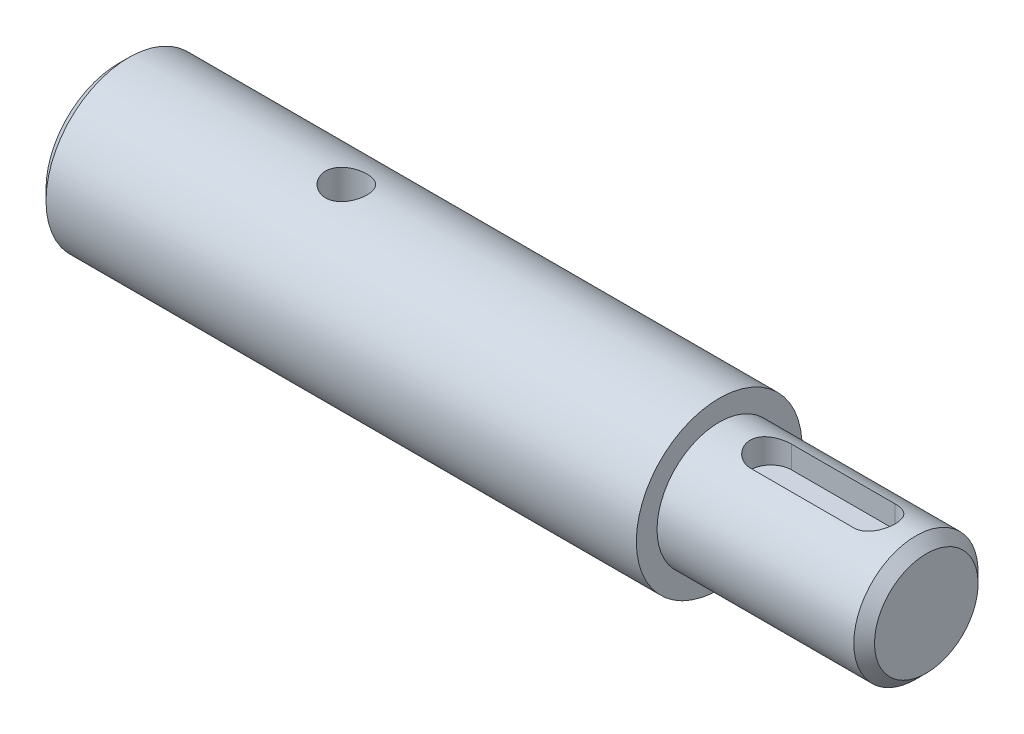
from build123d import *

# Parameters (mm, degrees)
CUT_EXTRUDE_1_DEPTH = 80.248028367


with BuildPart() as part:
    # Sketch 1 → Revolve 1 (revolve)
    with BuildSketch(Plane.XY, mode=Mode.PRIVATE) as revolve_1_sk:
        Polygon((0, 0), (0, 7), (1, 8), (58, 8), (58, 6), (77, 6), (78, 5), (78, 0), align=None)
    revolve(revolve_1_sk.sketch.rotate(Axis((0, 0, 0), (1, 0, 0)), 90), axis=Axis((0, 0, 0), (1, 0, 0)))

    # Sketch 2 → Cut-Extrude 1 (cut, through all)
    with BuildSketch(Plane(origin=(0, 3.5, 0), x_dir=(-1, 0, 0), z_dir=(0, 1, 0))):
        with BuildLine():
            Line((-63, -2), (-73, -2))
            ThreePointArc((-73, -2), (-75, 0), (-73, 2))
            Line((-73, 2), (-63, 2))
            ThreePointArc((-63, 2), (-61, 0), (-63, -2))
        make_face()
    extrude(amount=CUT_EXTRUDE_1_DEPTH, mode=Mode.SUBTRACT)

    # Sketch 3 → Cut-Revolve 1 (revolve, cut)
    with BuildSketch(Plane.ZY.offset(-22)):
        Polygon((0, 8.659826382), (-2, 8.659826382), (-2, -0.845299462), (0, -2), align=None)
    revolve(axis=Axis((22, 0, 0), (0, 1, 0)), mode=Mode.SUBTRACT)


solid = part.part
